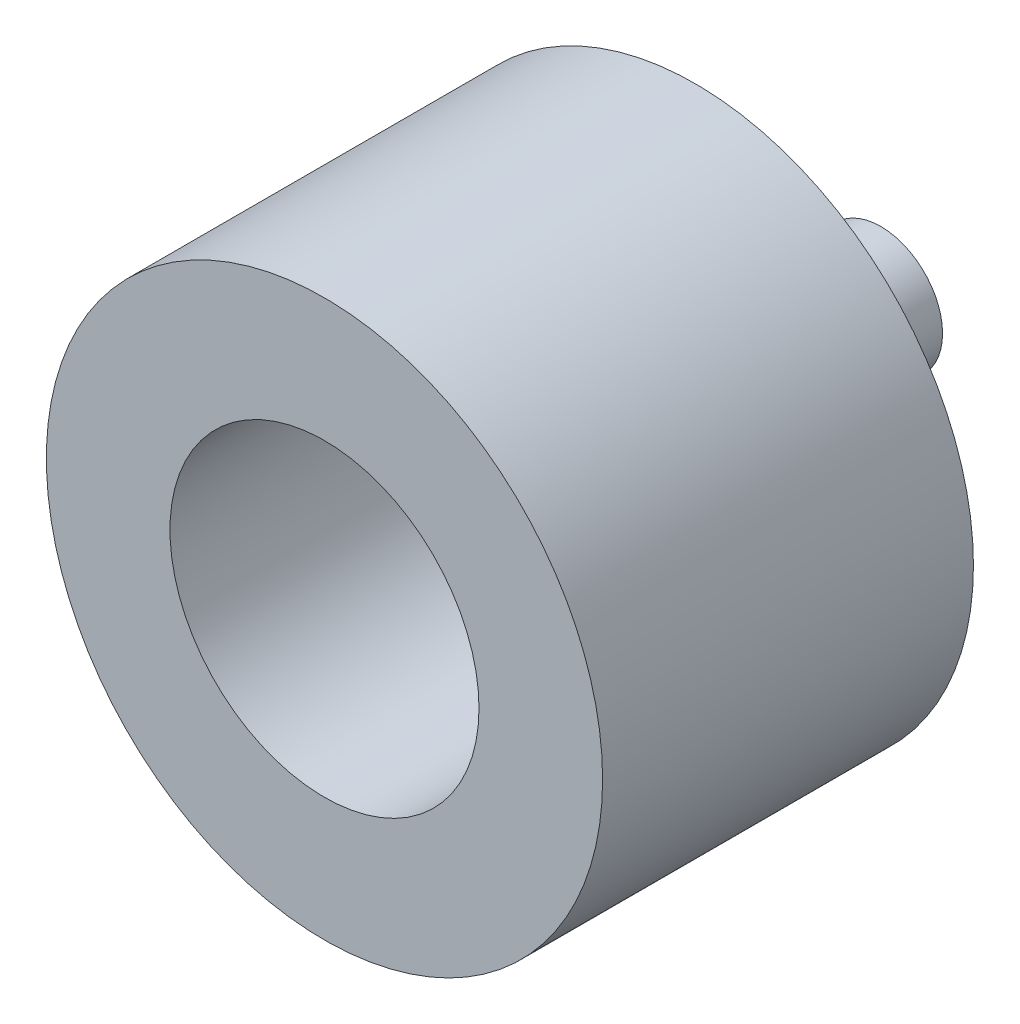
ISO-10303-21;
HEADER;
FILE_DESCRIPTION(('STEP AP214'),'2;1');
FILE_NAME('part.step','',(''),(''),'','','');
FILE_SCHEMA(('AUTOMOTIVE_DESIGN { 1 0 10303 214 1 1 1 1 }'));
ENDSEC;
DATA;
#1=APPLICATION_CONTEXT('core data for automotive mechanical design processes');
#2=APPLICATION_PROTOCOL_DEFINITION('international standard','automotive_design',2000,#1);
#3=PRODUCT_CONTEXT('',#1,'mechanical');
#4=PRODUCT('Part','Part','',(#3));
#5=PRODUCT_RELATED_PRODUCT_CATEGORY('part','',(#4));
#6=PRODUCT_DEFINITION_FORMATION('','',#4);
#7=PRODUCT_DEFINITION_CONTEXT('part definition',#1,'design');
#8=PRODUCT_DEFINITION('design','',#6,#7);
#9=PRODUCT_DEFINITION_SHAPE('','',#8);
#10=(LENGTH_UNIT() NAMED_UNIT(*) SI_UNIT(.MILLI.,.METRE.));
#11=(NAMED_UNIT(*) PLANE_ANGLE_UNIT() SI_UNIT($,.RADIAN.));
#12=(NAMED_UNIT(*) SI_UNIT($,.STERADIAN.) SOLID_ANGLE_UNIT());
#13=UNCERTAINTY_MEASURE_WITH_UNIT(LENGTH_MEASURE(1.E-05),#10,'distance_accuracy_value','');
#14=(GEOMETRIC_REPRESENTATION_CONTEXT(3) GLOBAL_UNCERTAINTY_ASSIGNED_CONTEXT((#13)) GLOBAL_UNIT_ASSIGNED_CONTEXT((#10,
#11,#12)) REPRESENTATION_CONTEXT('',''));
#15=CARTESIAN_POINT('',(0.,0.,0.));
#16=DIRECTION('',(0.,0.,1.));
#17=DIRECTION('',(1.,0.,0.));
#18=AXIS2_PLACEMENT_3D('',#15,#16,#17);
#19=CARTESIAN_POINT('',(0.,0.,0.));
#20=DIRECTION('',(0.,0.,1.));
#21=DIRECTION('',(1.,0.,0.));
#22=AXIS2_PLACEMENT_3D('',#19,#20,#21);
#23=PLANE('',#22);
#24=CARTESIAN_POINT('',(0.,0.,0.));
#25=DIRECTION('',(0.,0.,1.));
#26=DIRECTION('',(1.,0.,0.));
#27=AXIS2_PLACEMENT_3D('',#24,#25,#26);
#28=CIRCLE('',#27,4.5);
#29=CARTESIAN_POINT('',(4.5,0.,0.));
#30=VERTEX_POINT('',#29);
#31=EDGE_CURVE('E43',#30,#30,#28,.T.);
#32=ORIENTED_EDGE('',*,*,#31,.F.);
#33=EDGE_LOOP('',(#32));
#34=FACE_BOUND('',#33,.T.);
#35=CARTESIAN_POINT('',(0.,0.,0.));
#36=DIRECTION('',(0.,0.,1.));
#37=DIRECTION('',(1.,0.,0.));
#38=AXIS2_PLACEMENT_3D('',#35,#36,#37);
#39=CIRCLE('',#38,1.);
#40=CARTESIAN_POINT('',(1.,0.,0.));
#41=VERTEX_POINT('',#40);
#42=EDGE_CURVE('E10',#41,#41,#39,.F.);
#43=ORIENTED_EDGE('',*,*,#42,.F.);
#44=EDGE_LOOP('',(#43));
#45=FACE_BOUND('',#44,.T.);
#46=ADVANCED_FACE('F32',(#34,#45),#23,.F.);
#47=CARTESIAN_POINT('',(0.,0.,6.));
#48=DIRECTION('',(0.,0.,-1.));
#49=DIRECTION('',(-1.,0.,0.));
#50=AXIS2_PLACEMENT_3D('',#47,#48,#49);
#51=CYLINDRICAL_SURFACE('',#50,4.5);
#52=CARTESIAN_POINT('',(0.,0.,6.));
#53=DIRECTION('',(0.,0.,1.));
#54=DIRECTION('',(1.,0.,0.));
#55=AXIS2_PLACEMENT_3D('',#52,#53,#54);
#56=CIRCLE('',#55,4.5);
#57=CARTESIAN_POINT('',(4.5,0.,6.));
#58=VERTEX_POINT('',#57);
#59=EDGE_CURVE('E39',#58,#58,#56,.T.);
#60=ORIENTED_EDGE('',*,*,#59,.F.);
#61=EDGE_LOOP('',(#60));
#62=FACE_BOUND('',#61,.T.);
#63=ORIENTED_EDGE('',*,*,#31,.T.);
#64=EDGE_LOOP('',(#63));
#65=FACE_BOUND('',#64,.T.);
#66=ADVANCED_FACE('F34',(#62,#65),#51,.T.);
#67=CARTESIAN_POINT('',(0.,0.,6.));
#68=DIRECTION('',(0.,0.,1.));
#69=DIRECTION('',(1.,0.,0.));
#70=AXIS2_PLACEMENT_3D('',#67,#68,#69);
#71=PLANE('',#70);
#72=CARTESIAN_POINT('',(0.,0.,6.));
#73=DIRECTION('',(0.,0.,1.));
#74=DIRECTION('',(1.,0.,0.));
#75=AXIS2_PLACEMENT_3D('',#72,#73,#74);
#76=CIRCLE('',#75,2.5);
#77=CARTESIAN_POINT('',(2.5,0.,6.));
#78=VERTEX_POINT('',#77);
#79=EDGE_CURVE('E50',#78,#78,#76,.T.);
#80=ORIENTED_EDGE('',*,*,#79,.F.);
#81=EDGE_LOOP('',(#80));
#82=FACE_BOUND('',#81,.T.);
#83=ORIENTED_EDGE('',*,*,#59,.T.);
#84=EDGE_LOOP('',(#83));
#85=FACE_BOUND('',#84,.T.);
#86=ADVANCED_FACE('F78',(#82,#85),#71,.T.);
#87=CARTESIAN_POINT('',(0.,0.,1.));
#88=DIRECTION('',(0.,0.,1.));
#89=DIRECTION('',(1.,0.,0.));
#90=AXIS2_PLACEMENT_3D('',#87,#88,#89);
#91=CYLINDRICAL_SURFACE('',#90,2.5);
#92=CARTESIAN_POINT('',(0.,0.,1.));
#93=DIRECTION('',(0.,0.,1.));
#94=DIRECTION('',(1.,0.,0.));
#95=AXIS2_PLACEMENT_3D('',#92,#93,#94);
#96=CIRCLE('',#95,2.5);
#97=CARTESIAN_POINT('',(2.5,0.,1.));
#98=VERTEX_POINT('',#97);
#99=EDGE_CURVE('E48',#98,#98,#96,.T.);
#100=ORIENTED_EDGE('',*,*,#99,.F.);
#101=EDGE_LOOP('',(#100));
#102=FACE_BOUND('',#101,.T.);
#103=ORIENTED_EDGE('',*,*,#79,.T.);
#104=EDGE_LOOP('',(#103));
#105=FACE_BOUND('',#104,.T.);
#106=ADVANCED_FACE('F70',(#102,#105),#91,.F.);
#107=CARTESIAN_POINT('',(0.,0.,1.));
#108=DIRECTION('',(0.,0.,1.));
#109=DIRECTION('',(1.,0.,0.));
#110=AXIS2_PLACEMENT_3D('',#107,#108,#109);
#111=PLANE('',#110);
#112=ORIENTED_EDGE('',*,*,#99,.T.);
#113=EDGE_LOOP('',(#112));
#114=FACE_BOUND('',#113,.T.);
#115=ADVANCED_FACE('F63',(#114),#111,.T.);
#116=CARTESIAN_POINT('',(0.,0.,-3.));
#117=DIRECTION('',(0.,0.,1.));
#118=DIRECTION('',(1.,0.,0.));
#119=AXIS2_PLACEMENT_3D('',#116,#117,#118);
#120=CYLINDRICAL_SURFACE('',#119,1.);
#121=CARTESIAN_POINT('',(0.,0.,-3.));
#122=DIRECTION('',(0.,0.,-1.));
#123=DIRECTION('',(-1.,0.,0.));
#124=AXIS2_PLACEMENT_3D('',#121,#122,#123);
#125=CIRCLE('',#124,1.);
#126=CARTESIAN_POINT('',(-1.,0.,-3.));
#127=VERTEX_POINT('',#126);
#128=EDGE_CURVE('E53',#127,#127,#125,.T.);
#129=ORIENTED_EDGE('',*,*,#128,.F.);
#130=EDGE_LOOP('',(#129));
#131=FACE_BOUND('',#130,.T.);
#132=ORIENTED_EDGE('',*,*,#42,.T.);
#133=EDGE_LOOP('',(#132));
#134=FACE_BOUND('',#133,.T.);
#135=ADVANCED_FACE('F61',(#131,#134),#120,.T.);
#136=CARTESIAN_POINT('',(0.,0.,-3.));
#137=DIRECTION('',(0.,0.,-1.));
#138=DIRECTION('',(-1.,0.,0.));
#139=AXIS2_PLACEMENT_3D('',#136,#137,#138);
#140=PLANE('',#139);
#141=ORIENTED_EDGE('',*,*,#128,.T.);
#142=EDGE_LOOP('',(#141));
#143=FACE_BOUND('',#142,.T.);
#144=ADVANCED_FACE('F59',(#143),#140,.T.);
#145=CLOSED_SHELL('',(#46,#66,#86,#106,#115,#135,#144));
#146=MANIFOLD_SOLID_BREP('B2',#145);
#147=ADVANCED_BREP_SHAPE_REPRESENTATION('',(#18,#146),#14);
#148=SHAPE_DEFINITION_REPRESENTATION(#9,#147);
ENDSEC;
END-ISO-10303-21;
